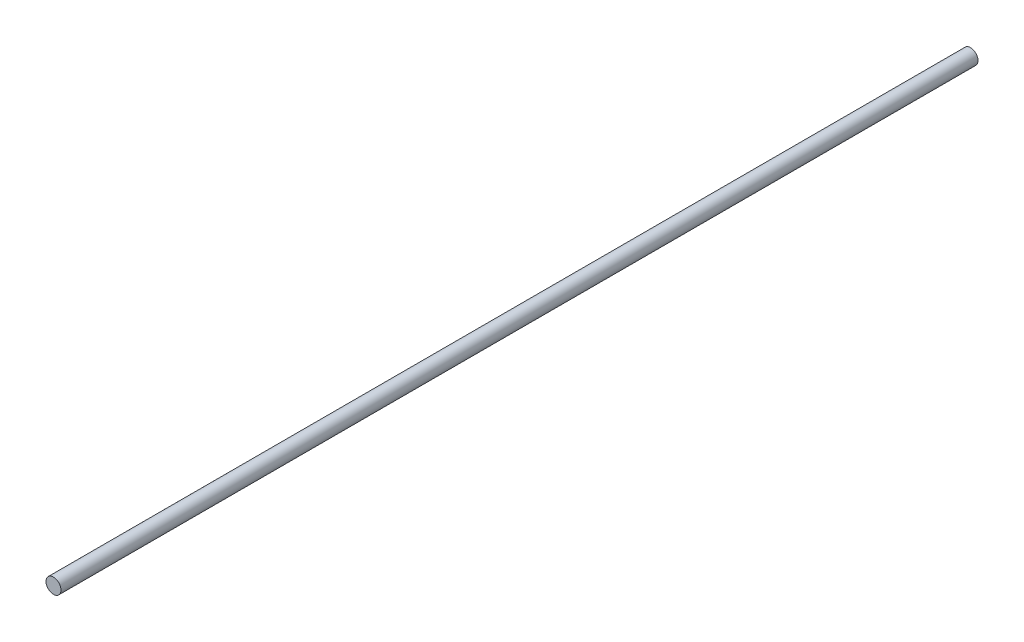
ISO-10303-21;
HEADER;
FILE_DESCRIPTION(('STEP AP214'),'2;1');
FILE_NAME('part.step','',(''),(''),'','','');
FILE_SCHEMA(('AUTOMOTIVE_DESIGN { 1 0 10303 214 1 1 1 1 }'));
ENDSEC;
DATA;
#1=APPLICATION_CONTEXT('core data for automotive mechanical design processes');
#2=APPLICATION_PROTOCOL_DEFINITION('international standard','automotive_design',2000,#1);
#3=PRODUCT_CONTEXT('',#1,'mechanical');
#4=PRODUCT('Part','Part','',(#3));
#5=PRODUCT_RELATED_PRODUCT_CATEGORY('part','',(#4));
#6=PRODUCT_DEFINITION_FORMATION('','',#4);
#7=PRODUCT_DEFINITION_CONTEXT('part definition',#1,'design');
#8=PRODUCT_DEFINITION('design','',#6,#7);
#9=PRODUCT_DEFINITION_SHAPE('','',#8);
#10=(LENGTH_UNIT() NAMED_UNIT(*) SI_UNIT(.MILLI.,.METRE.));
#11=(NAMED_UNIT(*) PLANE_ANGLE_UNIT() SI_UNIT($,.RADIAN.));
#12=(NAMED_UNIT(*) SI_UNIT($,.STERADIAN.) SOLID_ANGLE_UNIT());
#13=UNCERTAINTY_MEASURE_WITH_UNIT(LENGTH_MEASURE(1.E-05),#10,'distance_accuracy_value','');
#14=(GEOMETRIC_REPRESENTATION_CONTEXT(3) GLOBAL_UNCERTAINTY_ASSIGNED_CONTEXT((#13)) GLOBAL_UNIT_ASSIGNED_CONTEXT((#10,
#11,#12)) REPRESENTATION_CONTEXT('',''));
#15=CARTESIAN_POINT('',(0.,0.,0.));
#16=DIRECTION('',(0.,0.,1.));
#17=DIRECTION('',(1.,0.,0.));
#18=AXIS2_PLACEMENT_3D('',#15,#16,#17);
#19=CARTESIAN_POINT('',(0.,0.,122.5));
#20=DIRECTION('',(0.,0.,-1.));
#21=DIRECTION('',(-1.,0.,0.));
#22=AXIS2_PLACEMENT_3D('',#19,#20,#21);
#23=CYLINDRICAL_SURFACE('',#22,2.);
#24=CARTESIAN_POINT('',(0.,0.,122.5));
#25=DIRECTION('',(0.,0.,1.));
#26=DIRECTION('',(1.,0.,0.));
#27=AXIS2_PLACEMENT_3D('',#24,#25,#26);
#28=CIRCLE('',#27,2.);
#29=CARTESIAN_POINT('',(2.,0.,122.5));
#30=VERTEX_POINT('',#29);
#31=EDGE_CURVE('E10',#30,#30,#28,.T.);
#32=ORIENTED_EDGE('',*,*,#31,.F.);
#33=EDGE_LOOP('',(#32));
#34=FACE_BOUND('',#33,.T.);
#35=CARTESIAN_POINT('',(0.,0.,-122.5));
#36=DIRECTION('',(0.,0.,1.));
#37=DIRECTION('',(1.,0.,0.));
#38=AXIS2_PLACEMENT_3D('',#35,#36,#37);
#39=CIRCLE('',#38,2.);
#40=CARTESIAN_POINT('',(2.,0.,-122.5));
#41=VERTEX_POINT('',#40);
#42=EDGE_CURVE('E44',#41,#41,#39,.T.);
#43=ORIENTED_EDGE('',*,*,#42,.T.);
#44=EDGE_LOOP('',(#43));
#45=FACE_BOUND('',#44,.T.);
#46=ADVANCED_FACE('F38',(#34,#45),#23,.T.);
#47=CARTESIAN_POINT('',(0.,0.,122.5));
#48=DIRECTION('',(0.,0.,1.));
#49=DIRECTION('',(1.,0.,0.));
#50=AXIS2_PLACEMENT_3D('',#47,#48,#49);
#51=PLANE('',#50);
#52=ORIENTED_EDGE('',*,*,#31,.T.);
#53=EDGE_LOOP('',(#52));
#54=FACE_BOUND('',#53,.T.);
#55=ADVANCED_FACE('F53',(#54),#51,.T.);
#56=CARTESIAN_POINT('',(0.,0.,-122.5));
#57=DIRECTION('',(0.,0.,1.));
#58=DIRECTION('',(1.,0.,0.));
#59=AXIS2_PLACEMENT_3D('',#56,#57,#58);
#60=PLANE('',#59);
#61=ORIENTED_EDGE('',*,*,#42,.F.);
#62=EDGE_LOOP('',(#61));
#63=FACE_BOUND('',#62,.T.);
#64=ADVANCED_FACE('F51',(#63),#60,.F.);
#65=CLOSED_SHELL('',(#46,#55,#64));
#66=MANIFOLD_SOLID_BREP('B2',#65);
#67=ADVANCED_BREP_SHAPE_REPRESENTATION('',(#18,#66),#14);
#68=SHAPE_DEFINITION_REPRESENTATION(#9,#67);
ENDSEC;
END-ISO-10303-21;
